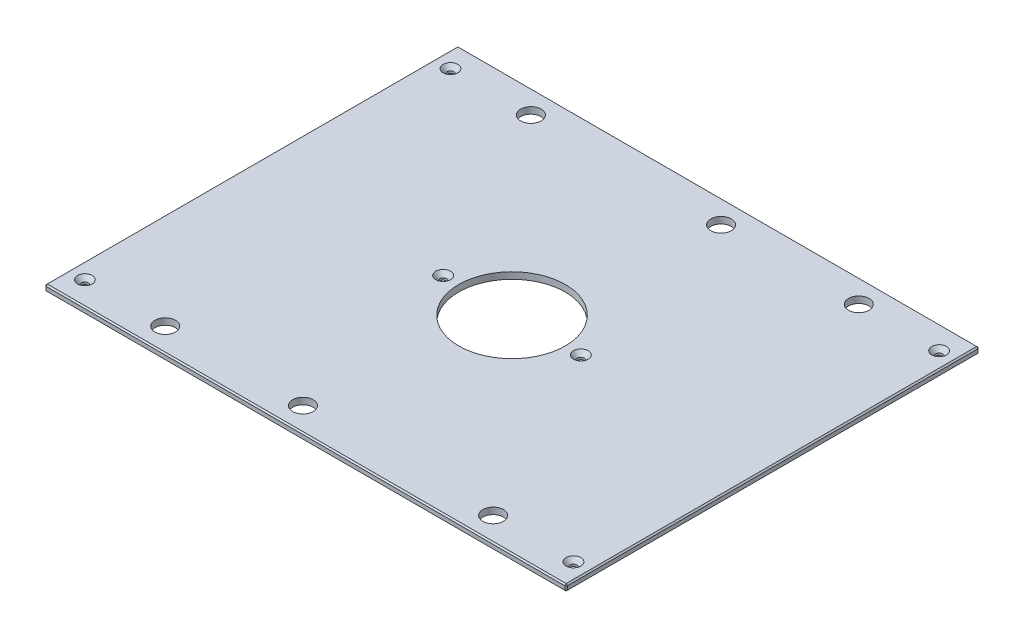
from build123d import *

# Parameters (mm, degrees)
SKETCH1_W                                     = 504.825
SKETCH1_H                                     = 400.05
BOSS_EXTRUDE1_DEPTH                           = 6.35
SKETCH13_R                                    = 51.562
CUT_EXTRUDE6_DEPTH                            = 323.121705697
F_25_32_0_78125_DIAMETER_HOLE1_D              = 19.84375
CHAMFER2_SIZE                                 = 1.27
CSK_FOR_1_4_FLAT_HEAD_MACHINE_SCREW1_AT_COUNT = 2
CSK_FOR_1_4_FLAT_HEAD_MACHINE_SCREW1_AT_PITCH = 354.00996
CSK_FOR_1_4_FLAT_HEAD_MACHINE_SCREW1_2_COUNT  = 2
CSK_FOR_1_4_FLAT_HEAD_MACHINE_SCREW1_2_PITCH  = 590.866319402
CSK_FOR_1_4_FLAT_HEAD_MACHINE_SCREW1_3_COUNT  = 2
CSK_FOR_1_4_FLAT_HEAD_MACHINE_SCREW1_3_PITCH  = 351.096259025
CSK_FOR_1_4_FLAT_HEAD_MACHINE_SCREW1_4_COUNT  = 2
CSK_FOR_1_4_FLAT_HEAD_MACHINE_SCREW1_4_PITCH  = 245.324340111
CSK_FOR_1_4_FLAT_HEAD_MACHINE_SCREW1_5_COUNT  = 2
CSK_FOR_1_4_FLAT_HEAD_MACHINE_SCREW1_5_PITCH  = 473.075
CSK_FOR_1_4_FLAT_HEAD_MACHINE_SCREW1_6_COUNT  = 2
CSK_FOR_1_4_FLAT_HEAD_MACHINE_SCREW1_6_PITCH  = 395.2875
CSK_FOR_1_4_FLAT_HEAD_MACHINE_SCREW1_7_COUNT  = 2
CSK_FOR_1_4_FLAT_HEAD_MACHINE_SCREW1_7_PITCH  = 530.636654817


with BuildPart() as part:
    # Sketch1 → Boss-Extrude1 (new body)
    with BuildSketch(Plane(origin=(0, 0, 0), x_dir=(1, 0, 0), z_dir=(0, 1, 0))):
        Rectangle(SKETCH1_W, SKETCH1_H)
    extrude(amount=BOSS_EXTRUDE1_DEPTH)

    # Sketch13 → Cut-Extrude6 (cut, through all)
    with BuildSketch(Plane(origin=(0, 6.35, 0), x_dir=(1, 0, 0), z_dir=(0, 1, 0))):
        with Locations(Location((0, 0, 0), (0, 0, 270))):
            Circle(SKETCH13_R)
    extrude(amount=-CUT_EXTRUDE6_DEPTH, mode=Mode.SUBTRACT)

    # 25_32 _0.78125_ Diameter Hole1 (through all)
    with Locations(Plane(origin=(0, 6.35, 0), x_dir=(1, 0, 0), z_dir=(0, 1, 0))):
        with Locations((158.75, 177.00498), (-158.75, 177.00498), (158.75, -177.00498), (-158.75, -177.00498), (25.4, 177.00498), (-25.4, -177.00498)):
            Hole(F_25_32_0_78125_DIAMETER_HOLE1_D / 2)

    # Chamfer2
    chamfer2_edges = [part.edges().sort_by_distance(p)[0] for p in [
        (252.4125, 6.35, 0),
        (0, 6.35, -200.025),
        (-252.4125, 6.35, 0),
        (0, 0, -200.025),
        (252.4125, 0, 0),
        (0, 0, 200.025),
        (-252.4125, 0, 0),
        (0, 6.35, 200.025),
        (-252.4125, 3.175, -200.025),
        (252.4125, 3.175, -200.025),
        (252.4125, 3.175, 200.025),
        (-252.4125, 3.175, 200.025),
    ]]
    chamfer(chamfer2_edges, length=CHAMFER2_SIZE)

    # Sketch24 → CSK for 1_4 Flat Head Machine Screw1 (revolve, cut)
    with BuildSketch(Plane(origin=(236.5375, 6.35, -177.00498), x_dir=(0, 0, 1), z_dir=(1, 0, 0))):
        Polygon((0, 0), (0, 6.35), (3.3782, 6.35), (3.3782, 4.324464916), (7.1374, 0), align=None)
    csk_for_1_4_flat_head_machine_screw1 = revolve(axis=Axis((236.5375, 12.7, -177.00498), (0, -1, 0)), mode=Mode.SUBTRACT)

    # CSK for 1_4 Flat Head Machine Screw1 at: CSK for 1_4 Flat Head Machine Screw1 ×2
    with Locations(*[(0, 0, i * CSK_FOR_1_4_FLAT_HEAD_MACHINE_SCREW1_AT_PITCH) for i in range(1, CSK_FOR_1_4_FLAT_HEAD_MACHINE_SCREW1_AT_COUNT)]):
        add(csk_for_1_4_flat_head_machine_screw1, mode=Mode.SUBTRACT)

    # CSK for 1_4 Flat Head Machine Screw1 2: CSK for 1_4 Flat Head Machine Screw1 ×2
    with Locations(*[Vector(-0.8006464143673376, 0, 0.5991371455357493) * (i * CSK_FOR_1_4_FLAT_HEAD_MACHINE_SCREW1_2_PITCH) for i in range(1, CSK_FOR_1_4_FLAT_HEAD_MACHINE_SCREW1_2_COUNT)]):
        add(csk_for_1_4_flat_head_machine_screw1, mode=Mode.SUBTRACT)

    # CSK for 1_4 Flat Head Machine Screw1 3: CSK for 1_4 Flat Head Machine Screw1 ×2
    with Locations(*[Vector(-0.8636164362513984, 0, 0.5041494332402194) * (i * CSK_FOR_1_4_FLAT_HEAD_MACHINE_SCREW1_3_PITCH) for i in range(1, CSK_FOR_1_4_FLAT_HEAD_MACHINE_SCREW1_3_COUNT)]):
        add(csk_for_1_4_flat_head_machine_screw1, mode=Mode.SUBTRACT)

    # CSK for 1_4 Flat Head Machine Screw1 4: CSK for 1_4 Flat Head Machine Screw1 ×2
    with Locations(*[Vector(-0.6923997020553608, 0, 0.7215141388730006) * (i * CSK_FOR_1_4_FLAT_HEAD_MACHINE_SCREW1_4_PITCH) for i in range(1, CSK_FOR_1_4_FLAT_HEAD_MACHINE_SCREW1_4_COUNT)]):
        add(csk_for_1_4_flat_head_machine_screw1, mode=Mode.SUBTRACT)

    # CSK for 1_4 Flat Head Machine Screw1 5: CSK for 1_4 Flat Head Machine Screw1 ×2
    with Locations(*[(-i * CSK_FOR_1_4_FLAT_HEAD_MACHINE_SCREW1_5_PITCH, 0, 0) for i in range(1, CSK_FOR_1_4_FLAT_HEAD_MACHINE_SCREW1_5_COUNT)]):
        add(csk_for_1_4_flat_head_machine_screw1, mode=Mode.SUBTRACT)

    # CSK for 1_4 Flat Head Machine Screw1 6: CSK for 1_4 Flat Head Machine Screw1 ×2
    with Locations(*[(-i * CSK_FOR_1_4_FLAT_HEAD_MACHINE_SCREW1_6_PITCH, 0, 0) for i in range(1, CSK_FOR_1_4_FLAT_HEAD_MACHINE_SCREW1_6_COUNT)]):
        add(csk_for_1_4_flat_head_machine_screw1, mode=Mode.SUBTRACT)

    # CSK for 1_4 Flat Head Machine Screw1 7: CSK for 1_4 Flat Head Machine Screw1 ×2
    with Locations(*[Vector(-0.7449306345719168, 0, 0.6671419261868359) * (i * CSK_FOR_1_4_FLAT_HEAD_MACHINE_SCREW1_7_PITCH) for i in range(1, CSK_FOR_1_4_FLAT_HEAD_MACHINE_SCREW1_7_COUNT)]):
        add(csk_for_1_4_flat_head_machine_screw1, mode=Mode.SUBTRACT)


solid = part.part
